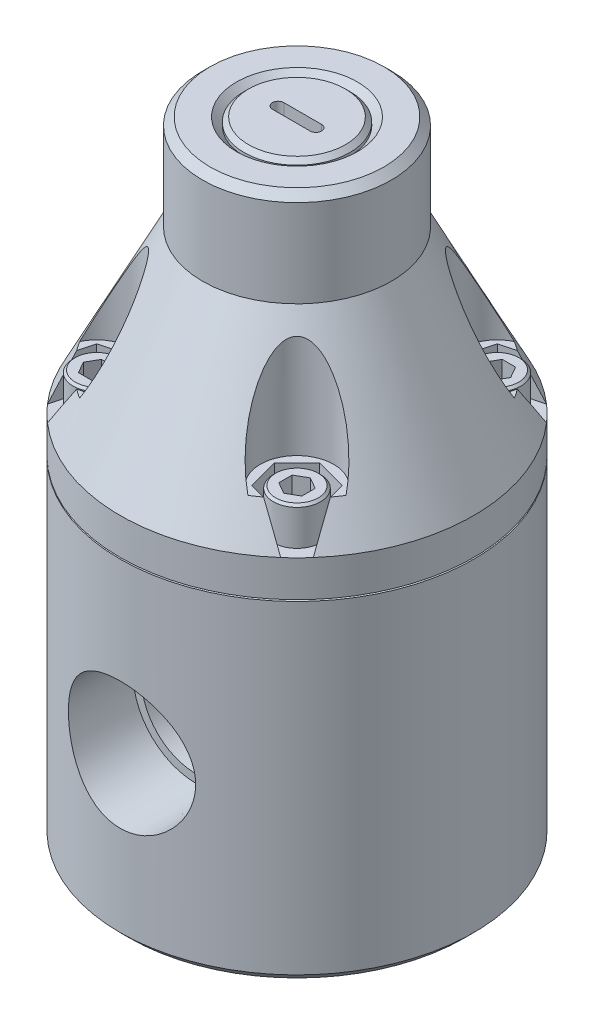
from build123d import *

# Parameters (mm, degrees)
SKETCH1_R                   = 29.718
EXTRUDE1_DEPTH              = 105.41
SKETCH3_R                   = 10.16
EXTRUDE2_DEPTH              = 1.27
EXTRUDE2_DRAFT              = -45
CHAMFER1_SIZE               = 1.27
CHAMFER2_SIZE               = 1.524
EXTRUDE3_REACH              = 115.479
SKETCH6_R                   = 8.89
CHAMFER3_SIZE               = 0.762
EXTRUDE4_DEPTH              = 4.7498
SKETCH8_R                   = 6.1722
EXTRUDE5_DEPTH              = 21.0058
CIRPATTERN2_COUNT           = 4
EXTRUDE6_DEPTH              = 6.35
CIRPATTERN3_COUNT           = 4
SKETCH10_R                  = 3.9624
EXTRUDE7_DEPTH              = 6.35
EXTRUDE8_DEPTH              = 3.175
CIRPATTERN4_COUNT           = 4
CHAMFER5_SIZE               = 0.381
SKETCH4_R                   = 10.7315
EXTRUDE10_DEPTH             = 12.7
EXTRUDE10_DRAFT             = -1
SKETCH12_R                  = 9.1186
EXTRUDE11_DEPTH             = 15.875
CIRPATTERN5_COUNT           = 2
CIRPATTERN5_COPY_1_SKETCH_R = 10.7315
CIRPATTERN5_COPY_1_DEPTH    = 12.7
CIRPATTERN5_COPY_1_DRAFT    = -1
SKETCH13_R                  = 10.7315
EXTRUDE12_DEPTH             = 13.97
EXTRUDE12_TAPER             = 1
SKETCH14_R                  = 9.1186
EXTRUDE13_DEPTH             = 15.875


with BuildPart() as part:
    # Sketch1 → Extrude1 (new body)
    with BuildSketch(Plane(origin=(0, 0, 0), x_dir=(1, 0, 0), z_dir=(0, 1, 0))):
        with Locations(Location((0, 0, 0), (0, 0, 270))):
            Circle(SKETCH1_R)
    extrude(amount=EXTRUDE1_DEPTH)

    # Sketch2 → Cut-Revolve1 (revolve, cut)
    with BuildSketch(Plane.XY, mode=Mode.PRIVATE) as cut_revolve1_sk:
        Polygon((-29.718, 55.88), (-20.625466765, 55.88), (-20.625466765, 56.134), (-29.718, 56.134), (-29.718, 62.23), (-15.875, 89.408), (-15.875, 105.41), (-21.125189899, 108.084162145), (-34.308703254, 108.084162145), (-34.308703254, 59.099585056), align=None)
    revolve(cut_revolve1_sk.sketch.rotate(Axis((0, 0, 0), (0, 1, 0)), 270), axis=Axis((0, 0, 0), (0, 1, 0)), mode=Mode.SUBTRACT)


with BuildPart() as extrude2_tool:
    # Sketch3 → Extrude2 (with draft: the straight prism first)
    with BuildSketch(Plane(origin=(0, 105.41, 0), x_dir=(-1, 0, 0), z_dir=(0, 1, 0))):
        Circle(SKETCH3_R)
    extrude(amount=-EXTRUDE2_DEPTH)
    # Extrude2: the draft: its side faces are tilted about the plane it starts from
    extrude2_sides = [extrude2_tool.faces().sort_by_distance(p)[0] for p in [
        (10.16, 104.775, 0),
    ]]
    draft(extrude2_sides, Plane(origin=(0, 105.41, 0), x_dir=(-1, 0, 0), z_dir=(0, 1, 0)), EXTRUDE2_DRAFT)


with BuildPart() as part_1:
    add(part.part)

    # Extrude2: cut by extrude2_tool
    add(extrude2_tool.part, mode=Mode.SUBTRACT)

    # Chamfer1
    chamfer1_edges = [part_1.edges().sort_by_distance(p)[0] for p in [
        (0, 105.41, 15.875),
    ]]
    chamfer(chamfer1_edges, length=CHAMFER1_SIZE)

    # Chamfer2
    chamfer2_edges = [part_1.edges().sort_by_distance(p)[0] for p in [
        (0, 0, -29.718),
    ]]
    chamfer(chamfer2_edges, length=CHAMFER2_SIZE)

    # Extrude3: up to this cone (the profile starts inside it)
    extrude3_end = Plane(origin=(0, 105.41, 0), z_dir=(0, 1, 0)).offset(-10.159999) * Cone(1e-06, 136.299, 136.298999, align=(Align.CENTER, Align.CENTER, Align.MIN), mode=Mode.PRIVATE)
    # Sketch6 → Extrude3 (add, up to the surface)
    with BuildSketch(Plane(origin=(0, 105.41, 0), x_dir=(-1, 0, 0), z_dir=(0, 1, 0)), mode=Mode.PRIVATE) as extrude3_sk1:
        with Locations(Location((0, 0, 0), (0, 0, 90))):
            Circle(SKETCH6_R)
    extrude3_tool1 = extrude(extrude3_sk1.sketch, amount=-EXTRUDE3_REACH, mode=Mode.PRIVATE) & extrude3_end
    add(extrude3_tool1.solids().sort_by_distance((0, 105.41, 0))[0])

    # Chamfer3
    chamfer3_edges = [part_1.edges().sort_by_distance(p)[0] for p in [
        (0, 105.41, -8.89),
    ]]
    chamfer(chamfer3_edges, length=CHAMFER3_SIZE)

    # Sketch7 → Extrude4 (cut)
    with BuildSketch(Plane(origin=(0, 105.41, 0), x_dir=(-1, 0, 0), z_dir=(0, 1, 0))):
        with BuildLine():
            Line((-3.175, 0.9652), (3.175, 0.9652))
            ThreePointArc((3.175, 0.9652), (4.1402, 0), (3.175, -0.9652))
            Line((3.175, -0.9652), (-3.175, -0.9652))
            ThreePointArc((-3.175, -0.9652), (-4.1402, 0), (-3.175, 0.9652))
        make_face()
    extrude(amount=-EXTRUDE4_DEPTH, mode=Mode.SUBTRACT)

    # Sketch8 → Extrude5 (cut)
    with BuildSketch(Plane(origin=(0, 68.58, 0), x_dir=(-1, 0, 0), z_dir=(0, 1, 0))):
        with Locations((-16.837980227, -16.837980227)):
            Circle(SKETCH8_R)
    extrude5 = extrude(amount=EXTRUDE5_DEPTH, mode=Mode.SUBTRACT)

    # CirPattern2: Extrude5 ×4 about axis
    cirpattern2_axis = Axis((0, 0, 0), (0, 1, 0))
    for i in range(1, CIRPATTERN2_COUNT):
        add(extrude5.rotate(cirpattern2_axis, i * 360 / CIRPATTERN2_COUNT), mode=Mode.SUBTRACT)

    # Sketch9 → Extrude6 (cut)
    with BuildSketch(Plane(origin=(0, 68.58, 0), x_dir=(-1, 0, 0), z_dir=(0, 1, 0))):
        Polygon((-20.633219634, -13.04274082), (-23.297950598, -23.297950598), (-13.04274082, -20.633219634), (-11.653586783, -15.44882619), (-15.44882619, -11.653586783), align=None)
    extrude6 = extrude(amount=-EXTRUDE6_DEPTH, mode=Mode.SUBTRACT)

    # CirPattern3: Extrude6 ×4 about axis
    cirpattern3_axis = Axis((0, 0, 0), (0, 1, 0))
    for i in range(1, CIRPATTERN3_COUNT):
        add(extrude6.rotate(cirpattern3_axis, i * 360 / CIRPATTERN3_COUNT), mode=Mode.SUBTRACT)

    # Sketch10 → Extrude7 (add)
    with BuildSketch(Plane(origin=(0, 68.58, 0), x_dir=(-1, 0, 0), z_dir=(0, 1, 0))):
        with Locations(Location((-16.837980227, -16.837980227, 0), (0, 0, 90))):
            Circle(SKETCH10_R)
    extrude7 = extrude(amount=-EXTRUDE7_DEPTH)

    # Sketch11 → Extrude8 (cut)
    with BuildSketch(Plane(origin=(0, 68.58, 0), x_dir=(-1, 0, 0), z_dir=(0, 1, 0))):
        Polygon((-19.075541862, -16.837980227), (-17.956761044, -18.775765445), (-15.71919941, -18.775765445), (-14.600418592, -16.837980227), (-15.71919941, -14.900195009), (-17.956761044, -14.900195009), align=None)
    extrude8 = extrude(amount=-EXTRUDE8_DEPTH, mode=Mode.SUBTRACT)

    # CirPattern4: Extrude7, Extrude8 ×4 about axis
    cirpattern4_axis = Axis((0, 0, 0), (0, 1, 0))
    add([extrude7.rotate(cirpattern4_axis, i * 360 / CIRPATTERN4_COUNT) for i in range(1, CIRPATTERN4_COUNT)])
    add([extrude8.rotate(cirpattern4_axis, i * 360 / CIRPATTERN4_COUNT) for i in range(1, CIRPATTERN4_COUNT)], mode=Mode.SUBTRACT)

    # Chamfer5
    chamfer5_edges = [part_1.edges().sort_by_distance(p)[0] for p in [
        (16.837980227, 68.58, -20.800380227),
        (20.800380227, 68.58, 16.837980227),
        (-16.837980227, 68.58, 20.800380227),
        (-20.800380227, 68.58, -16.837980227),
    ]]
    chamfer(chamfer5_edges, length=CHAMFER5_SIZE)


with BuildPart() as extrude10_tool:
    # Sketch4 → Extrude10 (with draft: the straight prism first)
    with BuildSketch(Plane.XY.offset(29.718)):
        with Locations((0, 27.432)):
            Circle(SKETCH4_R)
    extrude(amount=-EXTRUDE10_DEPTH)
    # Extrude10: the draft: its side faces are tilted about the plane it starts from
    extrude10_sides = [extrude10_tool.faces().sort_by_distance(p)[0] for p in [
        (-10.7315, 27.432, 23.368),
    ]]
    draft(extrude10_sides, Plane.XY.offset(29.718), EXTRUDE10_DRAFT)


with BuildPart() as part_2:
    add(part_1.part)

    # Extrude10: cut by extrude10_tool
    add(extrude10_tool.part, mode=Mode.SUBTRACT)

    # Sketch12 → Extrude11 (cut)
    with BuildSketch(Plane.XY.offset(29.718)):
        with Locations((0, 27.432)):
            Circle(SKETCH12_R)
    extrude11 = extrude(amount=-EXTRUDE11_DEPTH, mode=Mode.SUBTRACT)

    # CirPattern5: Extrude11 ×2 about axis
    cirpattern5_axis = Axis((0, 105.41, 0), (0, -1, 0))
    for i in range(1, CIRPATTERN5_COUNT):
        add(extrude11.rotate(cirpattern5_axis, i * 360 / CIRPATTERN5_COUNT), mode=Mode.SUBTRACT)


with BuildPart() as cirpattern5_copy_1_tool:
    # CirPattern5 copy 1 sketch → CirPattern5 copy 1 (with draft: the straight prism first)
    with BuildSketch(Plane(origin=(0, 0, -29.718), x_dir=(-1, 0, 0), z_dir=(0, 0, -1))):
        with Locations((0, 27.432)):
            Circle(CIRPATTERN5_COPY_1_SKETCH_R)
    extrude(amount=-CIRPATTERN5_COPY_1_DEPTH)
    # CirPattern5 copy 1: the draft: its side faces are tilted about the plane it starts from
    cirpattern5_copy_1_sides = [cirpattern5_copy_1_tool.faces().sort_by_distance(p)[0] for p in [
        (10.7315, 27.432, -23.368),
    ]]
    draft(cirpattern5_copy_1_sides, Plane(origin=(0, 0, -29.718), x_dir=(-1, 0, 0), z_dir=(0, 0, -1)), CIRPATTERN5_COPY_1_DRAFT)


with BuildPart() as part_3:
    add(part_2.part)

    # CirPattern5 copy 1: cut by cirpattern5_copy_1_tool
    add(cirpattern5_copy_1_tool.part, mode=Mode.SUBTRACT)

    # Sketch13 → Extrude12 (cut)
    with BuildSketch(Plane(origin=(0, 0, 0), x_dir=(1, 0, 0), z_dir=(0, 1, 0))):
        Circle(SKETCH13_R)
    extrude(amount=EXTRUDE12_DEPTH, taper=EXTRUDE12_TAPER, mode=Mode.SUBTRACT)

    # Sketch14 → Extrude13 (cut)
    with BuildSketch(Plane(origin=(0, 0, 0), x_dir=(1, 0, 0), z_dir=(0, 1, 0))):
        with Locations(Location((0, 0, 0), (0, 0, 270))):
            Circle(SKETCH14_R)
    extrude(amount=EXTRUDE13_DEPTH, mode=Mode.SUBTRACT)


solid = part_3.part
